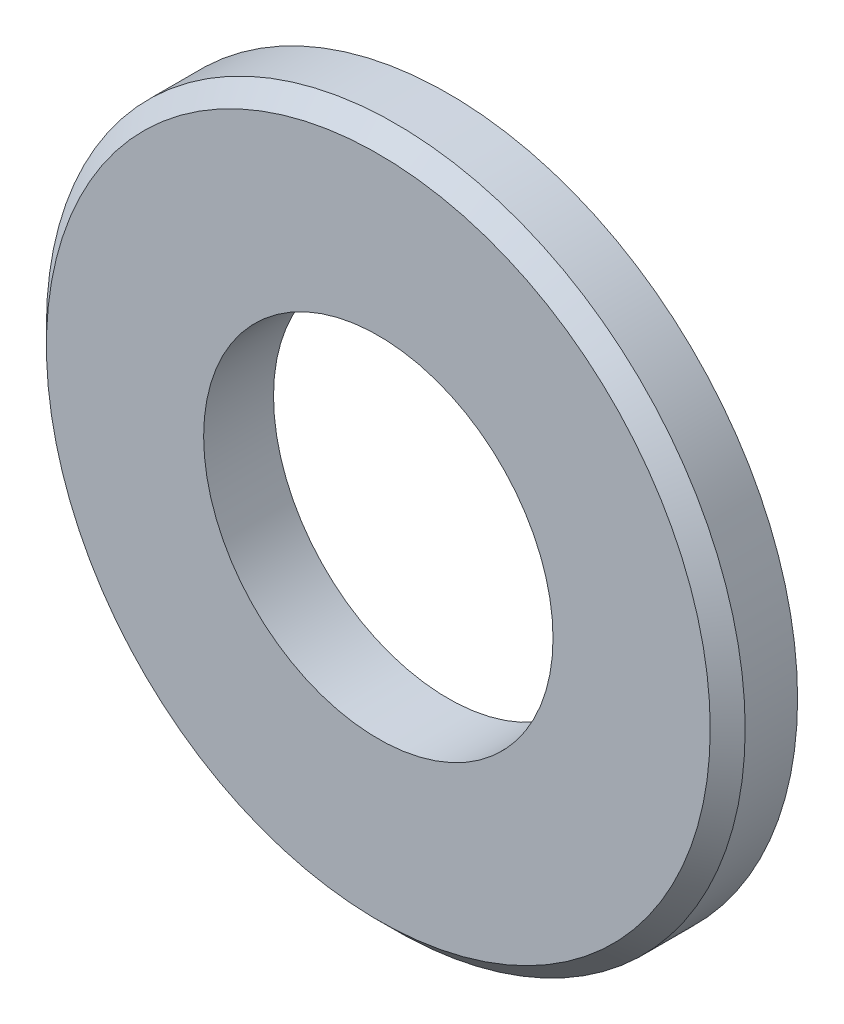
ISO-10303-21;
HEADER;
FILE_DESCRIPTION(('STEP AP214'),'2;1');
FILE_NAME('part.step','',(''),(''),'','','');
FILE_SCHEMA(('AUTOMOTIVE_DESIGN { 1 0 10303 214 1 1 1 1 }'));
ENDSEC;
DATA;
#1=APPLICATION_CONTEXT('core data for automotive mechanical design processes');
#2=APPLICATION_PROTOCOL_DEFINITION('international standard','automotive_design',2000,#1);
#3=PRODUCT_CONTEXT('',#1,'mechanical');
#4=PRODUCT('Part','Part','',(#3));
#5=PRODUCT_RELATED_PRODUCT_CATEGORY('part','',(#4));
#6=PRODUCT_DEFINITION_FORMATION('','',#4);
#7=PRODUCT_DEFINITION_CONTEXT('part definition',#1,'design');
#8=PRODUCT_DEFINITION('design','',#6,#7);
#9=PRODUCT_DEFINITION_SHAPE('','',#8);
#10=(LENGTH_UNIT() NAMED_UNIT(*) SI_UNIT(.MILLI.,.METRE.));
#11=(NAMED_UNIT(*) PLANE_ANGLE_UNIT() SI_UNIT($,.RADIAN.));
#12=(NAMED_UNIT(*) SI_UNIT($,.STERADIAN.) SOLID_ANGLE_UNIT());
#13=UNCERTAINTY_MEASURE_WITH_UNIT(LENGTH_MEASURE(1.E-05),#10,'distance_accuracy_value','');
#14=(GEOMETRIC_REPRESENTATION_CONTEXT(3) GLOBAL_UNCERTAINTY_ASSIGNED_CONTEXT((#13)) GLOBAL_UNIT_ASSIGNED_CONTEXT((#10,
#11,#12)) REPRESENTATION_CONTEXT('',''));
#15=CARTESIAN_POINT('',(0.,0.,0.));
#16=DIRECTION('',(0.,0.,1.));
#17=DIRECTION('',(1.,0.,0.));
#18=AXIS2_PLACEMENT_3D('',#15,#16,#17);
#19=CARTESIAN_POINT('',(0.,0.,-1.));
#20=DIRECTION('',(0.,0.,1.));
#21=DIRECTION('',(1.,0.,0.));
#22=AXIS2_PLACEMENT_3D('',#19,#20,#21);
#23=CYLINDRICAL_SURFACE('',#22,5.);
#24=CARTESIAN_POINT('',(0.,0.,-0.250000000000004));
#25=DIRECTION('',(0.,0.,1.));
#26=DIRECTION('',(1.,0.,0.));
#27=AXIS2_PLACEMENT_3D('',#24,#25,#26);
#28=CIRCLE('',#27,5.);
#29=CARTESIAN_POINT('',(5.,0.,-0.250000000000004));
#30=VERTEX_POINT('',#29);
#31=EDGE_CURVE('E10',#30,#30,#28,.F.);
#32=ORIENTED_EDGE('',*,*,#31,.T.);
#33=EDGE_LOOP('',(#32));
#34=FACE_BOUND('',#33,.T.);
#35=CARTESIAN_POINT('',(0.,0.,-1.));
#36=DIRECTION('',(0.,0.,1.));
#37=DIRECTION('',(1.,0.,0.));
#38=AXIS2_PLACEMENT_3D('',#35,#36,#37);
#39=CIRCLE('',#38,5.);
#40=CARTESIAN_POINT('',(5.,0.,-1.));
#41=VERTEX_POINT('',#40);
#42=EDGE_CURVE('E42',#41,#41,#39,.T.);
#43=ORIENTED_EDGE('',*,*,#42,.T.);
#44=EDGE_LOOP('',(#43));
#45=FACE_BOUND('',#44,.T.);
#46=ADVANCED_FACE('F31',(#34,#45),#23,.T.);
#47=CARTESIAN_POINT('',(0.,0.,-1.));
#48=DIRECTION('',(0.,0.,1.));
#49=DIRECTION('',(1.,0.,0.));
#50=AXIS2_PLACEMENT_3D('',#47,#48,#49);
#51=PLANE('',#50);
#52=CARTESIAN_POINT('',(0.,0.,-1.));
#53=DIRECTION('',(0.,0.,1.));
#54=DIRECTION('',(1.,0.,0.));
#55=AXIS2_PLACEMENT_3D('',#52,#53,#54);
#56=CIRCLE('',#55,2.5);
#57=CARTESIAN_POINT('',(2.5,0.,-1.));
#58=VERTEX_POINT('',#57);
#59=EDGE_CURVE('E46',#58,#58,#56,.T.);
#60=ORIENTED_EDGE('',*,*,#59,.T.);
#61=EDGE_LOOP('',(#60));
#62=FACE_BOUND('',#61,.T.);
#63=ORIENTED_EDGE('',*,*,#42,.F.);
#64=EDGE_LOOP('',(#63));
#65=FACE_BOUND('',#64,.T.);
#66=ADVANCED_FACE('F55',(#62,#65),#51,.F.);
#67=CARTESIAN_POINT('',(0.,0.,0.));
#68=DIRECTION('',(0.,0.,1.));
#69=DIRECTION('',(1.,0.,0.));
#70=AXIS2_PLACEMENT_3D('',#67,#68,#69);
#71=PLANE('',#70);
#72=CARTESIAN_POINT('',(0.,0.,0.));
#73=DIRECTION('',(0.,0.,1.));
#74=DIRECTION('',(1.,0.,0.));
#75=AXIS2_PLACEMENT_3D('',#72,#73,#74);
#76=CIRCLE('',#75,4.75);
#77=CARTESIAN_POINT('',(4.75,0.,0.));
#78=VERTEX_POINT('',#77);
#79=EDGE_CURVE('E38',#78,#78,#76,.T.);
#80=ORIENTED_EDGE('',*,*,#79,.T.);
#81=EDGE_LOOP('',(#80));
#82=FACE_BOUND('',#81,.T.);
#83=CARTESIAN_POINT('',(0.,0.,0.));
#84=DIRECTION('',(0.,0.,1.));
#85=DIRECTION('',(1.,0.,0.));
#86=AXIS2_PLACEMENT_3D('',#83,#84,#85);
#87=CIRCLE('',#86,2.5);
#88=CARTESIAN_POINT('',(2.5,0.,0.));
#89=VERTEX_POINT('',#88);
#90=EDGE_CURVE('E49',#89,#89,#87,.T.);
#91=ORIENTED_EDGE('',*,*,#90,.F.);
#92=EDGE_LOOP('',(#91));
#93=FACE_BOUND('',#92,.T.);
#94=ADVANCED_FACE('F61',(#82,#93),#71,.T.);
#95=CARTESIAN_POINT('',(0.,0.,-1.));
#96=DIRECTION('',(0.,0.,1.));
#97=DIRECTION('',(1.,0.,0.));
#98=AXIS2_PLACEMENT_3D('',#95,#96,#97);
#99=CYLINDRICAL_SURFACE('',#98,2.5);
#100=ORIENTED_EDGE('',*,*,#59,.F.);
#101=EDGE_LOOP('',(#100));
#102=FACE_BOUND('',#101,.T.);
#103=ORIENTED_EDGE('',*,*,#90,.T.);
#104=EDGE_LOOP('',(#103));
#105=FACE_BOUND('',#104,.T.);
#106=ADVANCED_FACE('F58',(#102,#105),#99,.F.);
#107=CARTESIAN_POINT('',(0.,0.,0.));
#108=DIRECTION('',(0.,0.,-1.));
#109=DIRECTION('',(-1.,0.,0.));
#110=AXIS2_PLACEMENT_3D('',#107,#108,#109);
#111=CONICAL_SURFACE('',#110,4.75,0.785398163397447);
#112=ORIENTED_EDGE('',*,*,#31,.F.);
#113=EDGE_LOOP('',(#112));
#114=FACE_BOUND('',#113,.T.);
#115=ORIENTED_EDGE('',*,*,#79,.F.);
#116=EDGE_LOOP('',(#115));
#117=FACE_BOUND('',#116,.T.);
#118=ADVANCED_FACE('F33',(#114,#117),#111,.T.);
#119=CLOSED_SHELL('',(#46,#66,#94,#106,#118));
#120=MANIFOLD_SOLID_BREP('B2',#119);
#121=ADVANCED_BREP_SHAPE_REPRESENTATION('',(#18,#120),#14);
#122=SHAPE_DEFINITION_REPRESENTATION(#9,#121);
ENDSEC;
END-ISO-10303-21;
